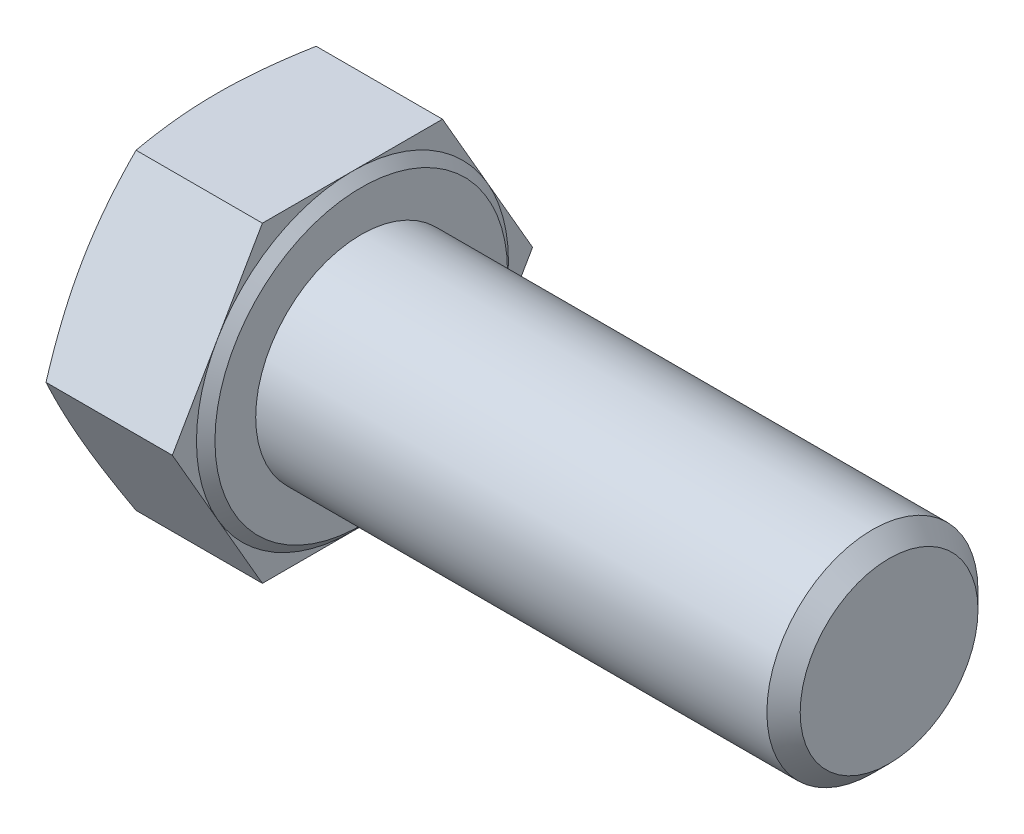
ISO-10303-21;
HEADER;
FILE_DESCRIPTION(('STEP AP214'),'2;1');
FILE_NAME('part.step','',(''),(''),'','','');
FILE_SCHEMA(('AUTOMOTIVE_DESIGN { 1 0 10303 214 1 1 1 1 }'));
ENDSEC;
DATA;
#1=APPLICATION_CONTEXT('core data for automotive mechanical design processes');
#2=APPLICATION_PROTOCOL_DEFINITION('international standard','automotive_design',2000,#1);
#3=PRODUCT_CONTEXT('',#1,'mechanical');
#4=PRODUCT('Part','Part','',(#3));
#5=PRODUCT_RELATED_PRODUCT_CATEGORY('part','',(#4));
#6=PRODUCT_DEFINITION_FORMATION('','',#4);
#7=PRODUCT_DEFINITION_CONTEXT('part definition',#1,'design');
#8=PRODUCT_DEFINITION('design','',#6,#7);
#9=PRODUCT_DEFINITION_SHAPE('','',#8);
#10=(LENGTH_UNIT() NAMED_UNIT(*) SI_UNIT(.MILLI.,.METRE.));
#11=(NAMED_UNIT(*) PLANE_ANGLE_UNIT() SI_UNIT($,.RADIAN.));
#12=(NAMED_UNIT(*) SI_UNIT($,.STERADIAN.) SOLID_ANGLE_UNIT());
#13=UNCERTAINTY_MEASURE_WITH_UNIT(LENGTH_MEASURE(1.E-05),#10,'distance_accuracy_value','');
#14=(GEOMETRIC_REPRESENTATION_CONTEXT(3) GLOBAL_UNCERTAINTY_ASSIGNED_CONTEXT((#13)) GLOBAL_UNIT_ASSIGNED_CONTEXT((#10,
#11,#12)) REPRESENTATION_CONTEXT('',''));
#15=CARTESIAN_POINT('',(0.,0.,0.));
#16=DIRECTION('',(0.,0.,1.));
#17=DIRECTION('',(1.,0.,0.));
#18=AXIS2_PLACEMENT_3D('',#15,#16,#17);
#19=CARTESIAN_POINT('',(8.18,0.,0.));
#20=DIRECTION('',(1.,0.,0.));
#21=DIRECTION('',(0.,0.,-1.));
#22=AXIS2_PLACEMENT_3D('',#19,#20,#21);
#23=PLANE('',#22);
#24=CARTESIAN_POINT('',(8.18,0.,0.));
#25=DIRECTION('',(-1.,0.,0.));
#26=DIRECTION('',(0.,0.,1.));
#27=AXIS2_PLACEMENT_3D('',#24,#25,#26);
#28=CIRCLE('',#27,8.315);
#29=CARTESIAN_POINT('',(8.18000000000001,0.,8.315));
#30=VERTEX_POINT('',#29);
#31=EDGE_CURVE('E161',#30,#30,#28,.T.);
#32=ORIENTED_EDGE('',*,*,#31,.F.);
#33=EDGE_LOOP('',(#32));
#34=FACE_BOUND('',#33,.T.);
#35=CARTESIAN_POINT('',(8.18,0.,0.));
#36=DIRECTION('',(1.,0.,0.));
#37=DIRECTION('',(0.,0.,-1.));
#38=AXIS2_PLACEMENT_3D('',#35,#36,#37);
#39=CIRCLE('',#38,6.);
#40=CARTESIAN_POINT('',(8.18,0.,-6.));
#41=VERTEX_POINT('',#40);
#42=EDGE_CURVE('E162',#41,#41,#39,.T.);
#43=ORIENTED_EDGE('',*,*,#42,.F.);
#44=EDGE_LOOP('',(#43));
#45=FACE_BOUND('',#44,.T.);
#46=ADVANCED_FACE('F55',(#34,#45),#23,.T.);
#47=CARTESIAN_POINT('',(7.68,-17.73,0.));
#48=DIRECTION('',(-1.,0.,0.));
#49=DIRECTION('',(0.,0.,1.));
#50=AXIS2_PLACEMENT_3D('',#47,#48,#49);
#51=PLANE('',#50);
#52=DIRECTION('',(0.,-0.866025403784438,0.5));
#53=VECTOR('',#52,1.);
#54=CARTESIAN_POINT('',(7.68,8.865,5.11821013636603));
#55=LINE('',#54,#53);
#56=CARTESIAN_POINT('',(7.68,8.865,5.11821013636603));
#57=VERTEX_POINT('',#56);
#58=CARTESIAN_POINT('',(7.68,4.4325,7.67731520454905));
#59=VERTEX_POINT('',#58);
#60=EDGE_CURVE('E159',#57,#59,#55,.T.);
#61=ORIENTED_EDGE('',*,*,#60,.T.);
#62=CARTESIAN_POINT('',(7.68,0.,0.));
#63=DIRECTION('',(-1.,0.,0.));
#64=DIRECTION('',(0.,0.,1.));
#65=AXIS2_PLACEMENT_3D('',#62,#63,#64);
#66=CIRCLE('',#65,8.865);
#67=CARTESIAN_POINT('',(7.68,8.865,0.));
#68=VERTEX_POINT('',#67);
#69=EDGE_CURVE('E71',#59,#68,#66,.T.);
#70=ORIENTED_EDGE('',*,*,#69,.T.);
#71=DIRECTION('',(0.,0.,1.));
#72=VECTOR('',#71,1.);
#73=CARTESIAN_POINT('',(7.68,8.865,-5.11821013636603));
#74=LINE('',#73,#72);
#75=EDGE_CURVE('E156',#68,#57,#74,.T.);
#76=ORIENTED_EDGE('',*,*,#75,.T.);
#77=EDGE_LOOP('',(#61,#70,#76));
#78=FACE_BOUND('',#77,.T.);
#79=ADVANCED_FACE('F155',(#78),#51,.F.);
#80=CARTESIAN_POINT('',(7.68,8.865,-5.11821013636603));
#81=VERTEX_POINT('',#80);
#82=EDGE_CURVE('E169',#81,#68,#74,.T.);
#83=ORIENTED_EDGE('',*,*,#82,.T.);
#84=CARTESIAN_POINT('',(7.68,4.4325,-7.67731520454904));
#85=VERTEX_POINT('',#84);
#86=EDGE_CURVE('E143',#68,#85,#66,.T.);
#87=ORIENTED_EDGE('',*,*,#86,.T.);
#88=DIRECTION('',(0.,0.866025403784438,0.5));
#89=VECTOR('',#88,1.);
#90=CARTESIAN_POINT('',(7.68,0.,-10.2364202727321));
#91=LINE('',#90,#89);
#92=EDGE_CURVE('E176',#85,#81,#91,.T.);
#93=ORIENTED_EDGE('',*,*,#92,.T.);
#94=EDGE_LOOP('',(#83,#87,#93));
#95=FACE_BOUND('',#94,.T.);
#96=ADVANCED_FACE('F175',(#95),#51,.F.);
#97=CARTESIAN_POINT('',(7.68,0.,-10.2364202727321));
#98=VERTEX_POINT('',#97);
#99=EDGE_CURVE('E173',#98,#85,#91,.T.);
#100=ORIENTED_EDGE('',*,*,#99,.T.);
#101=CARTESIAN_POINT('',(7.68,-4.4325,-7.67731520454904));
#102=VERTEX_POINT('',#101);
#103=EDGE_CURVE('E146',#85,#102,#66,.T.);
#104=ORIENTED_EDGE('',*,*,#103,.T.);
#105=DIRECTION('',(0.,0.866025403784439,-0.5));
#106=VECTOR('',#105,1.);
#107=CARTESIAN_POINT('',(7.68,-8.865,-5.11821013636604));
#108=LINE('',#107,#106);
#109=EDGE_CURVE('E341',#102,#98,#108,.T.);
#110=ORIENTED_EDGE('',*,*,#109,.T.);
#111=EDGE_LOOP('',(#100,#104,#110));
#112=FACE_BOUND('',#111,.T.);
#113=ADVANCED_FACE('F467',(#112),#51,.F.);
#114=CARTESIAN_POINT('',(7.68,-8.865,-5.11821013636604));
#115=VERTEX_POINT('',#114);
#116=EDGE_CURVE('E338',#115,#102,#108,.T.);
#117=ORIENTED_EDGE('',*,*,#116,.T.);
#118=CARTESIAN_POINT('',(7.68,-8.865,0.));
#119=VERTEX_POINT('',#118);
#120=EDGE_CURVE('E423',#102,#119,#66,.T.);
#121=ORIENTED_EDGE('',*,*,#120,.T.);
#122=DIRECTION('',(0.,0.,-1.));
#123=VECTOR('',#122,1.);
#124=CARTESIAN_POINT('',(7.68,-8.86499999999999,5.11821013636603));
#125=LINE('',#124,#123);
#126=EDGE_CURVE('E191',#119,#115,#125,.T.);
#127=ORIENTED_EDGE('',*,*,#126,.T.);
#128=EDGE_LOOP('',(#117,#121,#127));
#129=FACE_BOUND('',#128,.T.);
#130=ADVANCED_FACE('F319',(#129),#51,.F.);
#131=CARTESIAN_POINT('',(7.68,-8.86499999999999,5.11821013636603));
#132=VERTEX_POINT('',#131);
#133=EDGE_CURVE('E192',#132,#119,#125,.T.);
#134=ORIENTED_EDGE('',*,*,#133,.T.);
#135=CARTESIAN_POINT('',(7.68,-4.4325,7.67731520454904));
#136=VERTEX_POINT('',#135);
#137=EDGE_CURVE('E420',#119,#136,#66,.T.);
#138=ORIENTED_EDGE('',*,*,#137,.T.);
#139=DIRECTION('',(0.,-0.866025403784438,-0.5));
#140=VECTOR('',#139,1.);
#141=CARTESIAN_POINT('',(7.68,0.,10.2364202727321));
#142=LINE('',#141,#140);
#143=EDGE_CURVE('E186',#136,#132,#142,.T.);
#144=ORIENTED_EDGE('',*,*,#143,.T.);
#145=EDGE_LOOP('',(#134,#138,#144));
#146=FACE_BOUND('',#145,.T.);
#147=ADVANCED_FACE('F314',(#146),#51,.F.);
#148=CARTESIAN_POINT('',(7.68,-8.865,-5.11821013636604));
#149=DIRECTION('',(0.,0.5,0.866025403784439));
#150=DIRECTION('',(0.,-0.866025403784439,0.5));
#151=AXIS2_PLACEMENT_3D('',#148,#149,#150);
#152=PLANE('',#151);
#153=CARTESIAN_POINT('',(0.499198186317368,0.000200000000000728,-10.2365357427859));
#154=CARTESIAN_POINT('',(0.422020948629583,-0.36693563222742,-10.0245698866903));
#155=CARTESIAN_POINT('',(0.35181495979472,-0.735281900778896,-9.81190506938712));
#156=CARTESIAN_POINT('',(0.228298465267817,-1.47436940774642,-9.38519269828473));
#157=CARTESIAN_POINT('',(0.175001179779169,-1.84511229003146,-9.17114419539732));
#158=CARTESIAN_POINT('',(0.0887943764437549,-2.58487872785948,-8.74403984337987));
#159=CARTESIAN_POINT('',(0.0556968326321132,-2.95388538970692,-8.53099374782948));
#160=CARTESIAN_POINT('',(0.0113037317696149,-3.69276161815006,-8.10440335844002));
#161=CARTESIAN_POINT('',(0.,-4.06263080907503,-7.89085928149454));
#162=CARTESIAN_POINT('',(0.,-4.80236919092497,-7.46377112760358));
#163=CARTESIAN_POINT('',(0.0113037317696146,-5.17223838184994,-7.2502270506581));
#164=CARTESIAN_POINT('',(0.0556968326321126,-5.91111461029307,-6.82363666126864));
#165=CARTESIAN_POINT('',(0.088794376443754,-6.28012127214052,-6.61059056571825));
#166=CARTESIAN_POINT('',(0.175001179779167,-7.01988770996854,-6.18348621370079));
#167=CARTESIAN_POINT('',(0.228298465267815,-7.39063059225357,-5.96943771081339));
#168=CARTESIAN_POINT('',(0.351814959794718,-8.1297180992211,-5.542725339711));
#169=CARTESIAN_POINT('',(0.422020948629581,-8.49806436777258,-5.33006052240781));
#170=CARTESIAN_POINT('',(0.499198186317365,-8.8652,-5.1180946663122));
#171=B_SPLINE_CURVE_WITH_KNOTS('',3,(#153,#154,#155,#156,#157,#158,#159,#160,#161,#162,#163,
#164,#165,#166,#167,#168,#169,#170),.UNSPECIFIED.,.F.,.F.,(4,2,2,2,2,2,2,2,4),(0.,
1.29283198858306,2.58667231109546,3.86827775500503,5.14940238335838,6.43052701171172,
7.71213245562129,9.00597277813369,10.2988047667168),.UNSPECIFIED.);
#172=CARTESIAN_POINT('',(0.499156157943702,0.,-10.2364202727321));
#173=VERTEX_POINT('',#172);
#174=CARTESIAN_POINT('',(0.,-4.4325,-7.67731520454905));
#175=VERTEX_POINT('',#174);
#176=EDGE_CURVE('E324',#173,#175,#171,.T.);
#177=ORIENTED_EDGE('',*,*,#176,.F.);
#178=DIRECTION('',(-1.,0.,0.));
#179=VECTOR('',#178,1.);
#180=CARTESIAN_POINT('',(7.68,0.,-10.2364202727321));
#181=LINE('',#180,#179);
#182=EDGE_CURVE('E213',#98,#173,#181,.T.);
#183=ORIENTED_EDGE('',*,*,#182,.F.);
#184=ORIENTED_EDGE('',*,*,#109,.F.);
#185=ORIENTED_EDGE('',*,*,#116,.F.);
#186=DIRECTION('',(-1.,0.,0.));
#187=VECTOR('',#186,1.);
#188=CARTESIAN_POINT('',(7.68,-8.865,-5.11821013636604));
#189=LINE('',#188,#187);
#190=CARTESIAN_POINT('',(0.499156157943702,-8.865,-5.11821013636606));
#191=VERTEX_POINT('',#190);
#192=EDGE_CURVE('E196',#115,#191,#189,.T.);
#193=ORIENTED_EDGE('',*,*,#192,.T.);
#194=EDGE_CURVE('E279',#175,#191,#171,.T.);
#195=ORIENTED_EDGE('',*,*,#194,.F.);
#196=EDGE_LOOP('',(#177,#183,#184,#185,#193,#195));
#197=FACE_BOUND('',#196,.T.);
#198=ADVANCED_FACE('F309',(#197),#152,.F.);
#199=CARTESIAN_POINT('',(7.68,0.,-10.2364202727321));
#200=DIRECTION('',(0.,-0.5,0.866025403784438));
#201=DIRECTION('',(0.,-0.866025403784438,-0.5));
#202=AXIS2_PLACEMENT_3D('',#199,#200,#201);
#203=PLANE('',#202);
#204=CARTESIAN_POINT('',(0.499198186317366,8.8652,-5.1180946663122));
#205=CARTESIAN_POINT('',(0.422020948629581,8.49806436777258,-5.3300605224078));
#206=CARTESIAN_POINT('',(0.351814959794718,8.1297180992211,-5.54272533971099));
#207=CARTESIAN_POINT('',(0.228298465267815,7.39063059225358,-5.96943771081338));
#208=CARTESIAN_POINT('',(0.175001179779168,7.01988770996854,-6.18348621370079));
#209=CARTESIAN_POINT('',(0.0887943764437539,6.28012127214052,-6.61059056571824));
#210=CARTESIAN_POINT('',(0.0556968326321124,5.91111461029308,-6.82363666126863));
#211=CARTESIAN_POINT('',(0.0113037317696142,5.17223838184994,-7.25022705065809));
#212=CARTESIAN_POINT('',(0.,4.80236919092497,-7.46377112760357));
#213=CARTESIAN_POINT('',(0.,4.06263080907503,-7.89085928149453));
#214=CARTESIAN_POINT('',(0.0113037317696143,3.69276161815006,-8.10440335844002));
#215=CARTESIAN_POINT('',(0.0556968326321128,2.95388538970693,-8.53099374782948));
#216=CARTESIAN_POINT('',(0.0887943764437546,2.58487872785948,-8.74403984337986));
#217=CARTESIAN_POINT('',(0.175001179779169,1.84511229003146,-9.17114419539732));
#218=CARTESIAN_POINT('',(0.228298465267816,1.47436940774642,-9.38519269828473));
#219=CARTESIAN_POINT('',(0.351814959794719,0.7352819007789,-9.81190506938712));
#220=CARTESIAN_POINT('',(0.422020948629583,0.366935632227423,-10.0245698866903));
#221=CARTESIAN_POINT('',(0.499198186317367,-0.000199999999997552,-10.2365357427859));
#222=B_SPLINE_CURVE_WITH_KNOTS('',3,(#204,#205,#206,#207,#208,#209,#210,#211,#212,#213,#214,
#215,#216,#217,#218,#219,#220,#221),.UNSPECIFIED.,.F.,.F.,(4,2,2,2,2,2,2,2,4),(0.,
1.29283198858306,2.58667231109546,3.86827775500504,5.14940238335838,6.43052701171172,
7.7121324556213,9.0059727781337,10.2988047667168),.UNSPECIFIED.);
#223=CARTESIAN_POINT('',(0.499156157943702,8.865,-5.11821013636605));
#224=VERTEX_POINT('',#223);
#225=CARTESIAN_POINT('',(0.,4.43250000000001,-7.67731520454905));
#226=VERTEX_POINT('',#225);
#227=EDGE_CURVE('E299',#224,#226,#222,.T.);
#228=ORIENTED_EDGE('',*,*,#227,.F.);
#229=DIRECTION('',(-1.,0.,0.));
#230=VECTOR('',#229,1.);
#231=CARTESIAN_POINT('',(7.68,8.865,-5.11821013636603));
#232=LINE('',#231,#230);
#233=EDGE_CURVE('E210',#81,#224,#232,.T.);
#234=ORIENTED_EDGE('',*,*,#233,.F.);
#235=ORIENTED_EDGE('',*,*,#92,.F.);
#236=ORIENTED_EDGE('',*,*,#99,.F.);
#237=ORIENTED_EDGE('',*,*,#182,.T.);
#238=EDGE_CURVE('E292',#226,#173,#222,.T.);
#239=ORIENTED_EDGE('',*,*,#238,.F.);
#240=EDGE_LOOP('',(#228,#234,#235,#236,#237,#239));
#241=FACE_BOUND('',#240,.T.);
#242=ADVANCED_FACE('F306',(#241),#203,.F.);
#243=CARTESIAN_POINT('',(7.68,8.865,-5.11821013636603));
#244=DIRECTION('',(0.,-1.,0.));
#245=DIRECTION('',(0.,0.,-1.));
#246=AXIS2_PLACEMENT_3D('',#243,#244,#245);
#247=PLANE('',#246);
#248=CARTESIAN_POINT('',(2.66729255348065,8.865,-13.5512207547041));
#249=CARTESIAN_POINT('',(2.54516242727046,8.865,-13.1501360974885));
#250=CARTESIAN_POINT('',(2.42445740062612,8.865,-12.7486094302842));
#251=CARTESIAN_POINT('',(2.1866859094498,8.865,-11.9444470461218));
#252=CARTESIAN_POINT('',(2.06961973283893,8.865,-11.5418112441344));
#253=CARTESIAN_POINT('',(1.83971956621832,8.865,-10.7345164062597));
#254=CARTESIAN_POINT('',(1.72689387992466,8.865,-10.3298549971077));
#255=CARTESIAN_POINT('',(1.50679557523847,8.865,-9.51902688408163));
#256=CARTESIAN_POINT('',(1.39952285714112,8.865,-9.1128602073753));
#257=CARTESIAN_POINT('',(1.19318564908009,8.865,-8.30376994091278));
#258=CARTESIAN_POINT('',(1.09403626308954,8.865,-7.90086810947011));
#259=CARTESIAN_POINT('',(0.904178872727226,8.865,-7.09305955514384));
#260=CARTESIAN_POINT('',(0.813471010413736,8.865,-6.68815279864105));
#261=CARTESIAN_POINT('',(0.642611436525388,8.865,-5.87624379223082));
#262=CARTESIAN_POINT('',(0.562456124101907,8.865,-5.46924230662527));
#263=CARTESIAN_POINT('',(0.415142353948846,8.865,-4.65287640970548));
#264=CARTESIAN_POINT('',(0.347983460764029,8.865,-4.2435120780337));
#265=CARTESIAN_POINT('',(0.236040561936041,8.865,-3.46851652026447));
#266=CARTESIAN_POINT('',(0.189592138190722,8.865,-3.10312796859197));
#267=CARTESIAN_POINT('',(0.110966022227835,8.865,-2.37080582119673));
#268=CARTESIAN_POINT('',(0.078787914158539,8.865,-2.00387227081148));
#269=CARTESIAN_POINT('',(0.0302520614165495,8.865,-1.26920440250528));
#270=CARTESIAN_POINT('',(0.0138831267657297,8.865,-0.901470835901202));
#271=CARTESIAN_POINT('',(-0.00220562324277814,8.865,-0.165635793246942));
#272=CARTESIAN_POINT('',(-0.00192555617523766,8.865,0.202465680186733));
#273=CARTESIAN_POINT('',(0.0153120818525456,8.865,0.940139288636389));
#274=CARTESIAN_POINT('',(0.0323542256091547,8.865,1.30970941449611));
#275=CARTESIAN_POINT('',(0.0823317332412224,8.865,2.04776414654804));
#276=CARTESIAN_POINT('',(0.115267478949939,8.865,2.41624872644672));
#277=CARTESIAN_POINT('',(0.195491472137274,8.865,3.15195041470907));
#278=CARTESIAN_POINT('',(0.242792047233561,8.865,3.51916615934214));
#279=CARTESIAN_POINT('',(0.349827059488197,8.865,4.25176055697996));
#280=CARTESIAN_POINT('',(0.409561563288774,8.865,4.61713920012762));
#281=CARTESIAN_POINT('',(0.542957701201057,8.865,5.36528645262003));
#282=CARTESIAN_POINT('',(0.617188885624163,8.865,5.74795260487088));
#283=CARTESIAN_POINT('',(0.775205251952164,8.865,6.5113198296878));
#284=CARTESIAN_POINT('',(0.858991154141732,8.865,6.89202075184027));
#285=CARTESIAN_POINT('',(1.03435761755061,8.865,7.65172880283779));
#286=CARTESIAN_POINT('',(1.12594044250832,8.865,8.03073540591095));
#287=CARTESIAN_POINT('',(1.31541098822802,8.865,8.78715202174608));
#288=CARTESIAN_POINT('',(1.41329855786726,8.865,9.164562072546));
#289=CARTESIAN_POINT('',(1.61432901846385,8.865,9.91849411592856));
#290=CARTESIAN_POINT('',(1.71747849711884,8.865,10.2950143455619));
#291=CARTESIAN_POINT('',(1.92797370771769,8.865,11.0468783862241));
#292=CARTESIAN_POINT('',(2.03531945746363,8.865,11.4222221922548));
#293=CARTESIAN_POINT('',(2.25343759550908,8.865,12.1718406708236));
#294=CARTESIAN_POINT('',(2.36420939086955,8.865,12.5461155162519));
#295=CARTESIAN_POINT('',(2.58860690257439,8.865,13.2938096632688));
#296=CARTESIAN_POINT('',(2.70223263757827,8.865,13.6672289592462));
#297=CARTESIAN_POINT('',(3.04411686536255,8.865,14.7781527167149));
#298=CARTESIAN_POINT('',(3.2758154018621,8.865,15.5145983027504));
#299=CARTESIAN_POINT('',(3.74577835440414,8.865,16.9854197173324));
#300=CARTESIAN_POINT('',(3.98404308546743,8.865,17.7197954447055));
#301=CARTESIAN_POINT('',(4.4644742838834,8.865,19.1841817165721));
#302=CARTESIAN_POINT('',(4.70662251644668,8.865,19.9141982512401));
#303=CARTESIAN_POINT('',(5.07253100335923,8.865,21.0082896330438));
#304=CARTESIAN_POINT('',(5.19494320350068,8.865,21.3728165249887));
#305=CARTESIAN_POINT('',(5.44055969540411,8.865,22.1016024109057));
#306=CARTESIAN_POINT('',(5.56376398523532,8.865,22.4658614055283));
#307=CARTESIAN_POINT('',(5.68731140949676,8.865,22.8300040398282));
#308=B_SPLINE_CURVE_WITH_KNOTS('',3,(#248,#249,#250,#251,#252,#253,#254,#255,#256,#257,#258,
#259,#260,#261,#262,#263,#264,#265,#266,#267,#268,#269,#270,#271,#272,#273,#274,#275,#276,#277,
#278,#279,#280,#281,#282,#283,#284,#285,#286,#287,#288,#289,#290,#291,#292,#293,#294,#295,#296,
#297,#298,#299,#300,#301,#302,#303,#304,#305,#306,#307),.UNSPECIFIED.,.F.,.F.,(4,2,2,2,2,2,2,2,
2,2,2,2,2,2,2,2,2,2,2,2,2,2,2,2,2,2,2,2,2,4),(0.,1.25780938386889,2.51571803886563,
3.77597363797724,5.03620660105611,6.28090154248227,7.52561742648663,8.76990746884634,
10.0141558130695,11.118900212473,12.2236124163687,13.3275421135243,14.431464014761,
15.5409844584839,16.6505315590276,17.7610335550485,18.8715415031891,20.0407904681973,
21.2101276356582,22.379805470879,23.5494552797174,24.7206072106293,25.8917641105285,
27.0627194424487,28.233682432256,30.549734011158,32.865896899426,35.1732714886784,
36.3268658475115,37.4804573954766),.UNSPECIFIED.);
#309=CARTESIAN_POINT('',(0.499156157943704,8.86500000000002,5.11821013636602));
#310=VERTEX_POINT('',#309);
#311=CARTESIAN_POINT('',(0.,8.865,0.));
#312=VERTEX_POINT('',#311);
#313=EDGE_CURVE('E346',#310,#312,#308,.F.);
#314=ORIENTED_EDGE('',*,*,#313,.F.);
#315=DIRECTION('',(-1.,0.,0.));
#316=VECTOR('',#315,1.);
#317=CARTESIAN_POINT('',(7.68,8.865,5.11821013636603));
#318=LINE('',#317,#316);
#319=EDGE_CURVE('E171',#57,#310,#318,.T.);
#320=ORIENTED_EDGE('',*,*,#319,.F.);
#321=ORIENTED_EDGE('',*,*,#75,.F.);
#322=ORIENTED_EDGE('',*,*,#82,.F.);
#323=ORIENTED_EDGE('',*,*,#233,.T.);
#324=EDGE_CURVE('E300',#312,#224,#308,.F.);
#325=ORIENTED_EDGE('',*,*,#324,.F.);
#326=EDGE_LOOP('',(#314,#320,#321,#322,#323,#325));
#327=FACE_BOUND('',#326,.T.);
#328=ADVANCED_FACE('F167',(#327),#247,.F.);
#329=CARTESIAN_POINT('',(7.68,8.865,5.11821013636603));
#330=DIRECTION('',(0.,-0.5,-0.866025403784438));
#331=DIRECTION('',(0.,0.866025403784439,-0.5));
#332=AXIS2_PLACEMENT_3D('',#329,#330,#331);
#333=PLANE('',#332);
#334=CARTESIAN_POINT('',(0.499198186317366,-0.000199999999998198,10.2365357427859));
#335=CARTESIAN_POINT('',(0.422020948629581,0.366935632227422,10.0245698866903));
#336=CARTESIAN_POINT('',(0.351814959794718,0.735281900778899,9.81190506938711));
#337=CARTESIAN_POINT('',(0.228298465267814,1.47436940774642,9.38519269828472));
#338=CARTESIAN_POINT('',(0.175001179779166,1.84511229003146,9.17114419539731));
#339=CARTESIAN_POINT('',(0.0887943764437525,2.58487872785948,8.74403984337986));
#340=CARTESIAN_POINT('',(0.0556968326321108,2.95388538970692,8.53099374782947));
#341=CARTESIAN_POINT('',(0.0113037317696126,3.69276161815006,8.10440335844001));
#342=CARTESIAN_POINT('',(0.,4.06263080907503,7.89085928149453));
#343=CARTESIAN_POINT('',(0.,4.80236919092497,7.46377112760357));
#344=CARTESIAN_POINT('',(0.0113037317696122,5.17223838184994,7.25022705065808));
#345=CARTESIAN_POINT('',(0.0556968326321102,5.91111461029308,6.82363666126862));
#346=CARTESIAN_POINT('',(0.0887943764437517,6.28012127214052,6.61059056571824));
#347=CARTESIAN_POINT('',(0.175001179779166,7.01988770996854,6.18348621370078));
#348=CARTESIAN_POINT('',(0.228298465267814,7.39063059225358,5.96943771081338));
#349=CARTESIAN_POINT('',(0.351814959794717,8.1297180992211,5.54272533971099));
#350=CARTESIAN_POINT('',(0.422020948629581,8.49806436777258,5.3300605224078));
#351=CARTESIAN_POINT('',(0.499198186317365,8.8652,5.11809466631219));
#352=B_SPLINE_CURVE_WITH_KNOTS('',3,(#334,#335,#336,#337,#338,#339,#340,#341,#342,#343,#344,
#345,#346,#347,#348,#349,#350,#351),.UNSPECIFIED.,.F.,.F.,(4,2,2,2,2,2,2,2,4),(0.,
1.29283198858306,2.58667231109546,3.86827775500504,5.14940238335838,6.43052701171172,
7.71213245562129,9.00597277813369,10.2988047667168),.UNSPECIFIED.);
#353=CARTESIAN_POINT('',(0.499156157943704,0.,10.2364202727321));
#354=VERTEX_POINT('',#353);
#355=CARTESIAN_POINT('',(0.,4.4325,7.67731520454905));
#356=VERTEX_POINT('',#355);
#357=EDGE_CURVE('E285',#354,#356,#352,.T.);
#358=ORIENTED_EDGE('',*,*,#357,.F.);
#359=DIRECTION('',(-1.,0.,0.));
#360=VECTOR('',#359,1.);
#361=CARTESIAN_POINT('',(7.68,0.,10.2364202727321));
#362=LINE('',#361,#360);
#363=CARTESIAN_POINT('',(7.68,0.,10.2364202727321));
#364=VERTEX_POINT('',#363);
#365=EDGE_CURVE('E204',#364,#354,#362,.T.);
#366=ORIENTED_EDGE('',*,*,#365,.F.);
#367=EDGE_CURVE('E179',#59,#364,#55,.T.);
#368=ORIENTED_EDGE('',*,*,#367,.F.);
#369=ORIENTED_EDGE('',*,*,#60,.F.);
#370=ORIENTED_EDGE('',*,*,#319,.T.);
#371=EDGE_CURVE('E350',#356,#310,#352,.T.);
#372=ORIENTED_EDGE('',*,*,#371,.F.);
#373=EDGE_LOOP('',(#358,#366,#368,#369,#370,#372));
#374=FACE_BOUND('',#373,.T.);
#375=ADVANCED_FACE('F404',(#374),#333,.F.);
#376=CARTESIAN_POINT('',(7.68,0.,10.2364202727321));
#377=DIRECTION('',(0.,0.5,-0.866025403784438));
#378=DIRECTION('',(0.,0.866025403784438,0.5));
#379=AXIS2_PLACEMENT_3D('',#376,#377,#378);
#380=PLANE('',#379);
#381=CARTESIAN_POINT('',(0.499198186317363,-8.86519999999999,5.11809466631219));
#382=CARTESIAN_POINT('',(0.422020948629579,-8.49806436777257,5.33006052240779));
#383=CARTESIAN_POINT('',(0.351814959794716,-8.1297180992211,5.54272533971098));
#384=CARTESIAN_POINT('',(0.228298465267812,-7.39063059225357,5.96943771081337));
#385=CARTESIAN_POINT('',(0.175001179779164,-7.01988770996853,6.18348621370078));
#386=CARTESIAN_POINT('',(0.0887943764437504,-6.28012127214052,6.61059056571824));
#387=CARTESIAN_POINT('',(0.0556968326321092,-5.91111461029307,6.82363666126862));
#388=CARTESIAN_POINT('',(0.0113037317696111,-5.17223838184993,7.25022705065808));
#389=CARTESIAN_POINT('',(0.,-4.80236919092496,7.46377112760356));
#390=CARTESIAN_POINT('',(0.,-4.06263080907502,7.89085928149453));
#391=CARTESIAN_POINT('',(0.0113037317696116,-3.69276161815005,8.10440335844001));
#392=CARTESIAN_POINT('',(0.0556968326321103,-2.95388538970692,8.53099374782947));
#393=CARTESIAN_POINT('',(0.0887943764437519,-2.58487872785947,8.74403984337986));
#394=CARTESIAN_POINT('',(0.175001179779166,-1.84511229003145,9.17114419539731));
#395=CARTESIAN_POINT('',(0.228298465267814,-1.47436940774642,9.38519269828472));
#396=CARTESIAN_POINT('',(0.351814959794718,-0.735281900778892,9.81190506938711));
#397=CARTESIAN_POINT('',(0.422020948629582,-0.366935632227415,10.0245698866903));
#398=CARTESIAN_POINT('',(0.499198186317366,0.000200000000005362,10.2365357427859));
#399=B_SPLINE_CURVE_WITH_KNOTS('',3,(#381,#382,#383,#384,#385,#386,#387,#388,#389,#390,#391,
#392,#393,#394,#395,#396,#397,#398),.UNSPECIFIED.,.F.,.F.,(4,2,2,2,2,2,2,2,4),(0.,
1.29283198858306,2.58667231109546,3.86827775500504,5.14940238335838,6.43052701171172,
7.7121324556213,9.0059727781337,10.2988047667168),.UNSPECIFIED.);
#400=CARTESIAN_POINT('',(0.499156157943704,-8.86499999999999,5.11821013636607));
#401=VERTEX_POINT('',#400);
#402=CARTESIAN_POINT('',(0.,-4.4325,7.67731520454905));
#403=VERTEX_POINT('',#402);
#404=EDGE_CURVE('E271',#401,#403,#399,.T.);
#405=ORIENTED_EDGE('',*,*,#404,.F.);
#406=DIRECTION('',(-1.,0.,0.));
#407=VECTOR('',#406,1.);
#408=CARTESIAN_POINT('',(7.68,-8.86499999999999,5.11821013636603));
#409=LINE('',#408,#407);
#410=EDGE_CURVE('E200',#132,#401,#409,.T.);
#411=ORIENTED_EDGE('',*,*,#410,.F.);
#412=ORIENTED_EDGE('',*,*,#143,.F.);
#413=EDGE_CURVE('E187',#364,#136,#142,.T.);
#414=ORIENTED_EDGE('',*,*,#413,.F.);
#415=ORIENTED_EDGE('',*,*,#365,.T.);
#416=EDGE_CURVE('E330',#403,#354,#399,.T.);
#417=ORIENTED_EDGE('',*,*,#416,.F.);
#418=EDGE_LOOP('',(#405,#411,#412,#414,#415,#417));
#419=FACE_BOUND('',#418,.T.);
#420=ADVANCED_FACE('F400',(#419),#380,.F.);
#421=CARTESIAN_POINT('',(7.68,-8.86499999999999,5.11821013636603));
#422=DIRECTION('',(0.,1.,0.));
#423=DIRECTION('',(0.,0.,1.));
#424=AXIS2_PLACEMENT_3D('',#421,#422,#423);
#425=PLANE('',#424);
#426=CARTESIAN_POINT('',(2.66729303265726,-8.865,-13.5512223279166));
#427=CARTESIAN_POINT('',(2.54516288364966,-8.865,-13.1501376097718));
#428=CARTESIAN_POINT('',(2.42445783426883,-8.865,-12.7486108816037));
#429=CARTESIAN_POINT('',(2.18668629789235,-8.865,-11.9444483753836));
#430=CARTESIAN_POINT('',(2.06962009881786,-8.865,-11.5418125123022));
#431=CARTESIAN_POINT('',(1.83971988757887,-8.865,-10.7345175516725));
#432=CARTESIAN_POINT('',(1.7268941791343,-8.865,-10.3298560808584));
#433=CARTESIAN_POINT('',(1.50679583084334,-8.865,-9.51902784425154));
#434=CARTESIAN_POINT('',(1.39952309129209,-8.865,-9.11286110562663));
#435=CARTESIAN_POINT('',(1.1931858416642,-8.865,-8.30377071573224));
#436=CARTESIAN_POINT('',(1.09403643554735,-8.865,-7.90086882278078));
#437=CARTESIAN_POINT('',(0.904179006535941,-8.865,-7.09306014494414));
#438=CARTESIAN_POINT('',(0.813471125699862,-8.865,-6.68815332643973));
#439=CARTESIAN_POINT('',(0.642611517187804,-8.865,-5.87624419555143));
#440=CARTESIAN_POINT('',(0.56245618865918,-8.865,-5.46924264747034));
#441=CARTESIAN_POINT('',(0.415142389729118,-8.865,-4.65287662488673));
#442=CARTESIAN_POINT('',(0.347983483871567,-8.865,-4.24351223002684));
#443=CARTESIAN_POINT('',(0.236040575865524,-8.865,-3.4685166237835));
#444=CARTESIAN_POINT('',(0.18959215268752,-8.865,-3.10312808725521));
#445=CARTESIAN_POINT('',(0.110966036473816,-8.865,-2.3708059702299));
#446=CARTESIAN_POINT('',(0.078787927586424,-8.865,-2.00387243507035));
#447=CARTESIAN_POINT('',(0.0302520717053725,-8.865,-1.26920459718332));
#448=CARTESIAN_POINT('',(0.0138831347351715,-8.865,-0.90147104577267));
#449=CARTESIAN_POINT('',(-0.00220562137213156,-8.865,-0.165636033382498));
#450=CARTESIAN_POINT('',(-0.00192555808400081,-8.86499999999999,0.202465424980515));
#451=CARTESIAN_POINT('',(0.0153120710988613,-8.86499999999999,0.94013900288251));
#452=CARTESIAN_POINT('',(0.0323542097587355,-8.86499999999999,1.30970911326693));
#453=CARTESIAN_POINT('',(0.0823317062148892,-8.86499999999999,2.04776381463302));
#454=CARTESIAN_POINT('',(0.115267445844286,-8.86499999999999,2.41624837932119));
#455=CARTESIAN_POINT('',(0.195491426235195,-8.86499999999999,3.15195003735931));
#456=CARTESIAN_POINT('',(0.242791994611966,-8.86499999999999,3.5191657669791));
#457=CARTESIAN_POINT('',(0.349826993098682,-8.86499999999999,4.25176013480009));
#458=CARTESIAN_POINT('',(0.409561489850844,-8.86499999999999,4.61713876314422));
#459=CARTESIAN_POINT('',(0.542957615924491,-8.86499999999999,5.36528600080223));
#460=CARTESIAN_POINT('',(0.617188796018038,-8.86499999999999,5.74795215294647));
#461=CARTESIAN_POINT('',(0.775205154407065,-8.86499999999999,6.51131937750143));
#462=CARTESIAN_POINT('',(0.858991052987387,-8.86499999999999,6.89202029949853));
#463=CARTESIAN_POINT('',(1.03435750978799,-8.86499999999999,7.65172835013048));
#464=CARTESIAN_POINT('',(1.12594033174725,-8.86499999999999,8.03073495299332));
#465=CARTESIAN_POINT('',(1.3154108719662,-8.86499999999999,8.78715156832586));
#466=CARTESIAN_POINT('',(1.41329843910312,-8.86499999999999,9.16456161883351));
#467=CARTESIAN_POINT('',(1.61432889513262,-8.86499999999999,9.91849366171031));
#468=CARTESIAN_POINT('',(1.71747837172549,-8.86499999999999,10.2950138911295));
#469=CARTESIAN_POINT('',(1.9279735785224,-8.86499999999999,11.0468779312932));
#470=CARTESIAN_POINT('',(2.03531932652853,-8.86499999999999,11.4222217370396));
#471=CARTESIAN_POINT('',(2.25343746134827,-8.86499999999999,12.1718402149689));
#472=CARTESIAN_POINT('',(2.36420925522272,-8.86499999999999,12.5461150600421));
#473=CARTESIAN_POINT('',(2.58860676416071,-8.86499999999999,13.293809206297));
#474=CARTESIAN_POINT('',(2.70223249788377,-8.86499999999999,13.6672285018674));
#475=CARTESIAN_POINT('',(3.04411672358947,-8.86499999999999,14.7781522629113));
#476=CARTESIAN_POINT('',(3.27581525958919,-8.86499999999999,15.5145978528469));
#477=CARTESIAN_POINT('',(3.74577821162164,-8.86499999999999,16.9854192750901));
#478=CARTESIAN_POINT('',(3.98404294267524,-8.86499999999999,17.7197950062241));
#479=CARTESIAN_POINT('',(4.46447414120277,-8.86499999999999,19.1841812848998));
#480=CARTESIAN_POINT('',(4.70662237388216,-8.86499999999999,19.9141978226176));
#481=CARTESIAN_POINT('',(5.07253086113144,-8.86499999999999,21.0082892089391));
#482=CARTESIAN_POINT('',(5.19494306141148,-8.86499999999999,21.3728161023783));
#483=CARTESIAN_POINT('',(5.44055955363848,-8.86499999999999,22.1016019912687));
#484=CARTESIAN_POINT('',(5.56376384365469,-8.86499999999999,22.4658609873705));
#485=CARTESIAN_POINT('',(5.68731126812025,-8.86499999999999,22.8300036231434));
#486=B_SPLINE_CURVE_WITH_KNOTS('',3,(#426,#427,#428,#429,#430,#431,#432,#433,#434,#435,#436,
#437,#438,#439,#440,#441,#442,#443,#444,#445,#446,#447,#448,#449,#450,#451,#452,#453,#454,#455,
#456,#457,#458,#459,#460,#461,#462,#463,#464,#465,#466,#467,#468,#469,#470,#471,#472,#473,#474,
#475,#476,#477,#478,#479,#480,#481,#482,#483,#484,#485),.UNSPECIFIED.,.F.,.F.,(4,2,2,2,2,2,2,2,
2,2,2,2,2,2,2,2,2,2,2,2,2,2,2,2,2,2,2,2,2,4),(0.,1.25780957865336,2.51571842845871,
3.77597422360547,5.03620738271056,6.28090251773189,7.52561859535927,8.76990883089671,
10.0141573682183,11.1189017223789,12.2236138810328,13.3275435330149,14.4314653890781,
15.5409857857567,16.6505328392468,17.7610347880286,18.871542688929,20.0407916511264,
21.2101288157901,22.3798066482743,23.5494564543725,24.7206083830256,25.8917652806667,
27.0627206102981,28.2336835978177,30.5497351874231,32.8658980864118,35.1732726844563,
36.3268670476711,37.4804586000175),.UNSPECIFIED.);
#487=CARTESIAN_POINT('',(0.,-8.86499999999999,0.));
#488=VERTEX_POINT('',#487);
#489=EDGE_CURVE('E363',#191,#488,#486,.T.);
#490=ORIENTED_EDGE('',*,*,#489,.F.);
#491=ORIENTED_EDGE('',*,*,#192,.F.);
#492=ORIENTED_EDGE('',*,*,#126,.F.);
#493=ORIENTED_EDGE('',*,*,#133,.F.);
#494=ORIENTED_EDGE('',*,*,#410,.T.);
#495=EDGE_CURVE('E260',#488,#401,#486,.T.);
#496=ORIENTED_EDGE('',*,*,#495,.F.);
#497=EDGE_LOOP('',(#490,#491,#492,#493,#494,#496));
#498=FACE_BOUND('',#497,.T.);
#499=ADVANCED_FACE('F397',(#498),#425,.F.);
#500=ORIENTED_EDGE('',*,*,#413,.T.);
#501=EDGE_CURVE('E163',#136,#59,#66,.T.);
#502=ORIENTED_EDGE('',*,*,#501,.T.);
#503=ORIENTED_EDGE('',*,*,#367,.T.);
#504=EDGE_LOOP('',(#500,#502,#503));
#505=FACE_BOUND('',#504,.T.);
#506=ADVANCED_FACE('F244',(#505),#51,.F.);
#507=CARTESIAN_POINT('',(0.,0.,0.));
#508=DIRECTION('',(1.,0.,0.));
#509=DIRECTION('',(0.,0.,-1.));
#510=AXIS2_PLACEMENT_3D('',#507,#508,#509);
#511=CONICAL_SURFACE('',#510,8.865,1.22173047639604);
#512=ORIENTED_EDGE('',*,*,#357,.T.);
#513=CARTESIAN_POINT('',(0.,0.,0.));
#514=DIRECTION('',(-1.,0.,0.));
#515=DIRECTION('',(0.,0.,1.));
#516=AXIS2_PLACEMENT_3D('',#513,#514,#515);
#517=CIRCLE('',#516,8.865);
#518=EDGE_CURVE('E217',#403,#356,#517,.T.);
#519=ORIENTED_EDGE('',*,*,#518,.F.);
#520=ORIENTED_EDGE('',*,*,#416,.T.);
#521=EDGE_LOOP('',(#512,#519,#520));
#522=FACE_BOUND('',#521,.T.);
#523=ADVANCED_FACE('F433',(#522),#511,.T.);
#524=ORIENTED_EDGE('',*,*,#404,.T.);
#525=EDGE_CURVE('E220',#488,#403,#517,.T.);
#526=ORIENTED_EDGE('',*,*,#525,.F.);
#527=ORIENTED_EDGE('',*,*,#495,.T.);
#528=EDGE_LOOP('',(#524,#526,#527));
#529=FACE_BOUND('',#528,.T.);
#530=ADVANCED_FACE('F255',(#529),#511,.T.);
#531=ORIENTED_EDGE('',*,*,#194,.T.);
#532=ORIENTED_EDGE('',*,*,#489,.T.);
#533=EDGE_CURVE('E427',#175,#488,#517,.T.);
#534=ORIENTED_EDGE('',*,*,#533,.F.);
#535=EDGE_LOOP('',(#531,#532,#534));
#536=FACE_BOUND('',#535,.T.);
#537=ADVANCED_FACE('F432',(#536),#511,.T.);
#538=ORIENTED_EDGE('',*,*,#238,.T.);
#539=ORIENTED_EDGE('',*,*,#176,.T.);
#540=EDGE_CURVE('E424',#226,#175,#517,.T.);
#541=ORIENTED_EDGE('',*,*,#540,.F.);
#542=EDGE_LOOP('',(#538,#539,#541));
#543=FACE_BOUND('',#542,.T.);
#544=ADVANCED_FACE('F438',(#543),#511,.T.);
#545=ORIENTED_EDGE('',*,*,#324,.T.);
#546=ORIENTED_EDGE('',*,*,#227,.T.);
#547=EDGE_CURVE('E221',#312,#226,#517,.T.);
#548=ORIENTED_EDGE('',*,*,#547,.F.);
#549=EDGE_LOOP('',(#545,#546,#548));
#550=FACE_BOUND('',#549,.T.);
#551=ADVANCED_FACE('F254',(#550),#511,.T.);
#552=ORIENTED_EDGE('',*,*,#313,.T.);
#553=CARTESIAN_POINT('',(0.,0.,0.));
#554=DIRECTION('',(-1.,0.,0.));
#555=DIRECTION('',(0.,0.,1.));
#556=AXIS2_PLACEMENT_3D('',#553,#554,#555);
#557=CIRCLE('',#556,8.865);
#558=EDGE_CURVE('E79',#356,#312,#557,.T.);
#559=ORIENTED_EDGE('',*,*,#558,.F.);
#560=ORIENTED_EDGE('',*,*,#371,.T.);
#561=EDGE_LOOP('',(#552,#559,#560));
#562=FACE_BOUND('',#561,.T.);
#563=ADVANCED_FACE('F250',(#562),#511,.T.);
#564=CARTESIAN_POINT('',(0.,-17.73,0.));
#565=DIRECTION('',(-1.,0.,0.));
#566=DIRECTION('',(0.,0.,1.));
#567=AXIS2_PLACEMENT_3D('',#564,#565,#566);
#568=PLANE('',#567);
#569=ORIENTED_EDGE('',*,*,#518,.T.);
#570=ORIENTED_EDGE('',*,*,#558,.T.);
#571=ORIENTED_EDGE('',*,*,#547,.T.);
#572=ORIENTED_EDGE('',*,*,#540,.T.);
#573=ORIENTED_EDGE('',*,*,#533,.T.);
#574=ORIENTED_EDGE('',*,*,#525,.T.);
#575=EDGE_LOOP('',(#569,#570,#571,#572,#573,#574));
#576=FACE_BOUND('',#575,.T.);
#577=ADVANCED_FACE('F253',(#576),#568,.T.);
#578=CARTESIAN_POINT('',(7.68,0.,0.));
#579=DIRECTION('',(-1.,0.,0.));
#580=DIRECTION('',(0.,0.,1.));
#581=AXIS2_PLACEMENT_3D('',#578,#579,#580);
#582=CONICAL_SURFACE('',#581,8.865,0.832981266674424);
#583=ORIENTED_EDGE('',*,*,#31,.T.);
#584=EDGE_LOOP('',(#583));
#585=FACE_BOUND('',#584,.T.);
#586=ORIENTED_EDGE('',*,*,#69,.F.);
#587=ORIENTED_EDGE('',*,*,#501,.F.);
#588=ORIENTED_EDGE('',*,*,#137,.F.);
#589=ORIENTED_EDGE('',*,*,#120,.F.);
#590=ORIENTED_EDGE('',*,*,#103,.F.);
#591=ORIENTED_EDGE('',*,*,#86,.F.);
#592=EDGE_LOOP('',(#586,#587,#588,#589,#590,#591));
#593=FACE_BOUND('',#592,.T.);
#594=ADVANCED_FACE('F144',(#585,#593),#582,.T.);
#595=CARTESIAN_POINT('',(38.18,0.,0.));
#596=DIRECTION('',(-1.,0.,0.));
#597=DIRECTION('',(0.,0.,1.));
#598=AXIS2_PLACEMENT_3D('',#595,#596,#597);
#599=CYLINDRICAL_SURFACE('',#598,6.);
#600=CARTESIAN_POINT('',(37.233,0.,0.));
#601=DIRECTION('',(1.,0.,0.));
#602=DIRECTION('',(0.,0.,-1.));
#603=AXIS2_PLACEMENT_3D('',#600,#601,#602);
#604=CIRCLE('',#603,6.);
#605=CARTESIAN_POINT('',(37.233,0.,-6.00000000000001));
#606=VERTEX_POINT('',#605);
#607=EDGE_CURVE('E11',#606,#606,#604,.F.);
#608=ORIENTED_EDGE('',*,*,#607,.T.);
#609=EDGE_LOOP('',(#608));
#610=FACE_BOUND('',#609,.T.);
#611=ORIENTED_EDGE('',*,*,#42,.T.);
#612=EDGE_LOOP('',(#611));
#613=FACE_BOUND('',#612,.T.);
#614=ADVANCED_FACE('F233',(#610,#613),#599,.T.);
#615=CARTESIAN_POINT('',(38.18,0.,0.));
#616=DIRECTION('',(1.,0.,0.));
#617=DIRECTION('',(0.,0.,-1.));
#618=AXIS2_PLACEMENT_3D('',#615,#616,#617);
#619=PLANE('',#618);
#620=CARTESIAN_POINT('',(38.18,0.,0.));
#621=DIRECTION('',(1.,0.,0.));
#622=DIRECTION('',(0.,0.,-1.));
#623=AXIS2_PLACEMENT_3D('',#620,#621,#622);
#624=CIRCLE('',#623,5.05299999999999);
#625=CARTESIAN_POINT('',(38.18,0.,-5.053));
#626=VERTEX_POINT('',#625);
#627=EDGE_CURVE('E64',#626,#626,#624,.T.);
#628=ORIENTED_EDGE('',*,*,#627,.T.);
#629=EDGE_LOOP('',(#628));
#630=FACE_BOUND('',#629,.T.);
#631=ADVANCED_FACE('F226',(#630),#619,.T.);
#632=CARTESIAN_POINT('',(38.18,0.,0.));
#633=DIRECTION('',(-1.,0.,0.));
#634=DIRECTION('',(0.,0.,1.));
#635=AXIS2_PLACEMENT_3D('',#632,#633,#634);
#636=CONICAL_SURFACE('',#635,5.05299999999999,0.785398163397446);
#637=ORIENTED_EDGE('',*,*,#607,.F.);
#638=EDGE_LOOP('',(#637));
#639=FACE_BOUND('',#638,.T.);
#640=ORIENTED_EDGE('',*,*,#627,.F.);
#641=EDGE_LOOP('',(#640));
#642=FACE_BOUND('',#641,.T.);
#643=ADVANCED_FACE('F57',(#639,#642),#636,.T.);
#644=CLOSED_SHELL('',(#46,#79,#96,#113,#130,#147,#198,#242,#328,#375,#420,#499,#506,#523,#530,
#537,#544,#551,#563,#577,#594,#614,#631,#643));
#645=MANIFOLD_SOLID_BREP('B2',#644);
#646=ADVANCED_BREP_SHAPE_REPRESENTATION('',(#18,#645),#14);
#647=SHAPE_DEFINITION_REPRESENTATION(#9,#646);
ENDSEC;
END-ISO-10303-21;
